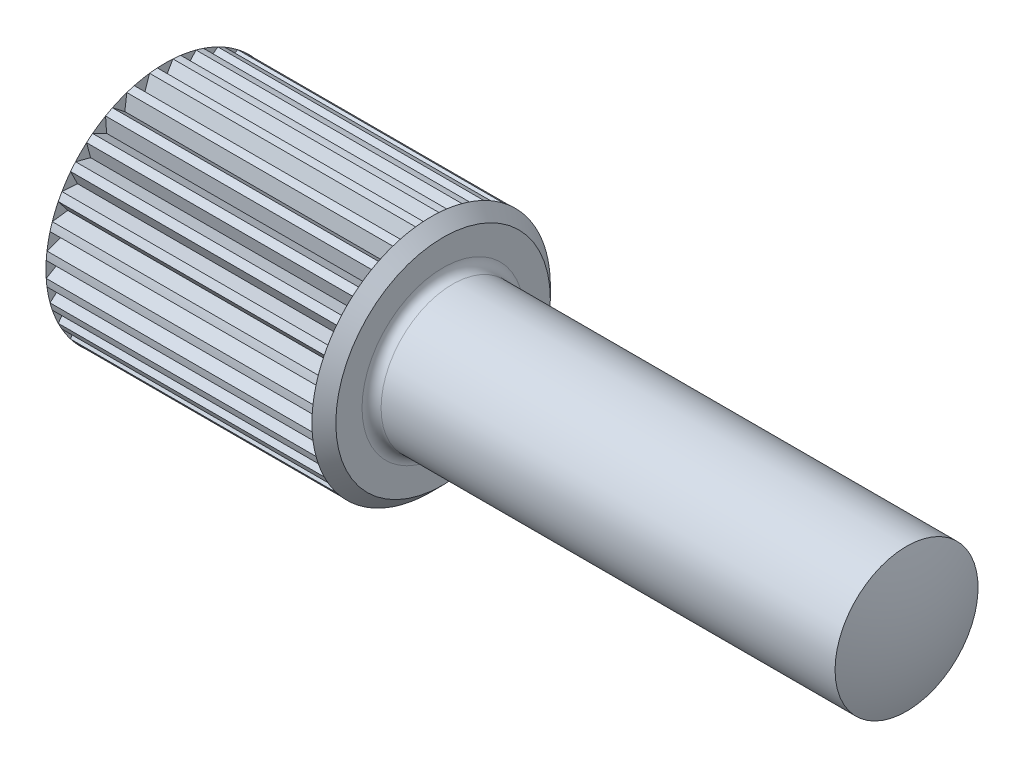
from build123d import *

# Parameters (mm, degrees)
CHAMFER1_SIZE           = 0.5
CUT_EXTRUDE1_DEPTH      = 11.160254
CIRCULAR_PATTERN1_COUNT = 32
FILLET1_R               = 0.4


with BuildPart() as part:
    # Sketch1 → Base (revolve)
    with BuildSketch(Plane.XY):
        with BuildLine():
            Line((0, 0), (33, 0))
            ThreePointArc((33, 0), (32.860343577, 1.525360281), (32.446018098, 3))
            Line((32.446018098, 3), (13, 3))
            Line((13, 3), (13, 5))
            Line((13, 5), (1.339745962, 5))
            ThreePointArc((1.339745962, 5), (0.340741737, 2.588190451), (0, 0))
        make_face()
    revolve(axis=Axis((-48.211075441, 0, 0), (1, 0, 0)))

    # Chamfer1
    chamfer1_edges = [part.edges().sort_by_distance(p)[0] for p in [
        (13, -5, 0),
    ]]
    chamfer(chamfer1_edges, length=CHAMFER1_SIZE)

    # Sketch2 → Cut-Extrude1 (cut)
    with BuildSketch(Plane(origin=(1.339745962, 0, 0), x_dir=(0, 0, -1), z_dir=(1, 0, 0))):
        Polygon((0, 4.422649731), (0.5, 5.288675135), (-0.5, 5.288675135), align=None)
    cut_extrude1 = extrude(amount=CUT_EXTRUDE1_DEPTH, mode=Mode.SUBTRACT)

    # Circular-Pattern1: Cut-Extrude1 ×32 about axis
    circular_pattern1_axis = Axis((0, 0, 0), (1, 0, 0))
    for i in range(1, CIRCULAR_PATTERN1_COUNT):
        add(cut_extrude1.rotate(circular_pattern1_axis, i * 360 / CIRCULAR_PATTERN1_COUNT), mode=Mode.SUBTRACT)

    # Fillet1
    fillet1_edges = [part.edges().sort_by_distance(p)[0] for p in [
        (13, -3, 0),
    ]]
    fillet(fillet1_edges, radius=FILLET1_R)


solid = part.part
